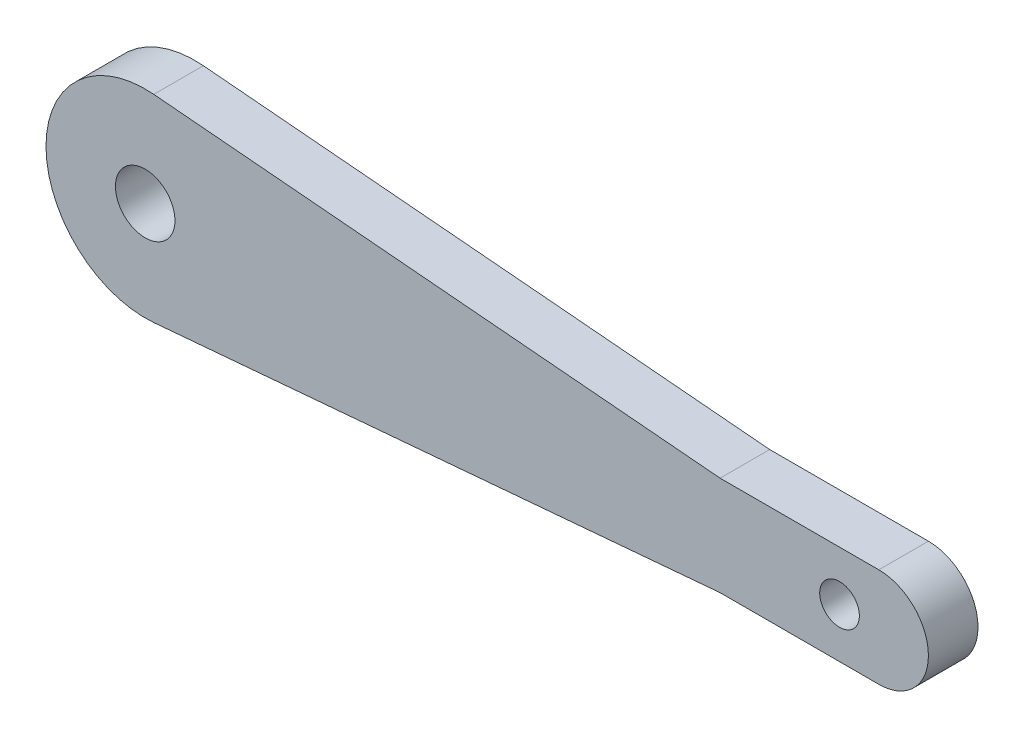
from build123d import *

# Parameters (mm, degrees)
ESQUISSE1_R        = 1
ESQUISSE1_R_2      = 1.5
BOSS_EXTRU_1_DEPTH = 1.25


with BuildPart() as part:
    # Esquisse1 → Boss.-Extru.1 (new, symmetric)
    with BuildSketch(Plane.XY):
        with BuildLine():
            Line((0, 2.5), (-8, 2.5))
            Line((-8, 2.5), (-36.547047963, 4.981219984))
            ThreePointArc((-36.547047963, 4.981219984), (-41.98, 0), (-36.547047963, -4.981219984))
            Line((-36.547047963, -4.981219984), (-8, -2.5))
            Line((-8, -2.5), (0, -2.5))
            ThreePointArc((0, -2.5), (2.5, 0), (0, 2.5))
        make_face()
        with Locations((-1.98, 0)):
            Circle(ESQUISSE1_R, mode=Mode.SUBTRACT)
        with Locations((-36.98, 0)):
            Circle(ESQUISSE1_R_2, mode=Mode.SUBTRACT)
    extrude(amount=BOSS_EXTRU_1_DEPTH, both=True)


solid = part.part
